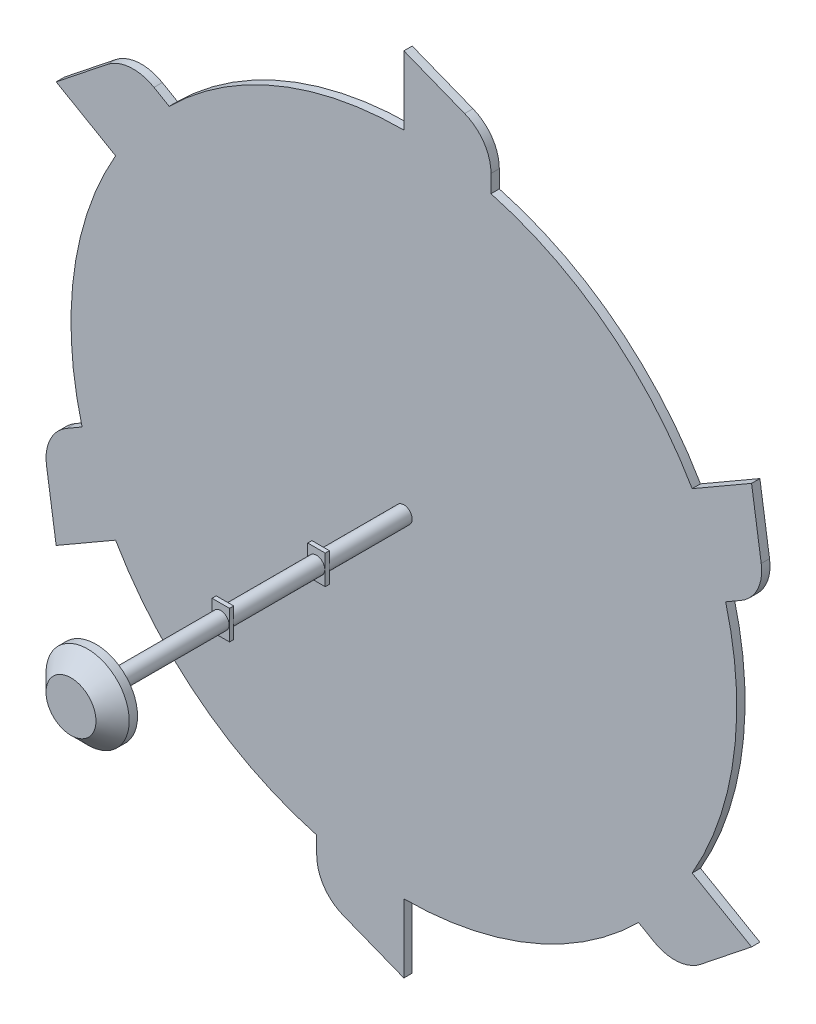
ISO-10303-21;
HEADER;
FILE_DESCRIPTION(('STEP AP214'),'2;1');
FILE_NAME('part.step','',(''),(''),'','','');
FILE_SCHEMA(('AUTOMOTIVE_DESIGN { 1 0 10303 214 1 1 1 1 }'));
ENDSEC;
DATA;
#1=APPLICATION_CONTEXT('core data for automotive mechanical design processes');
#2=APPLICATION_PROTOCOL_DEFINITION('international standard','automotive_design',2000,#1);
#3=PRODUCT_CONTEXT('',#1,'mechanical');
#4=PRODUCT('Part','Part','',(#3));
#5=PRODUCT_RELATED_PRODUCT_CATEGORY('part','',(#4));
#6=PRODUCT_DEFINITION_FORMATION('','',#4);
#7=PRODUCT_DEFINITION_CONTEXT('part definition',#1,'design');
#8=PRODUCT_DEFINITION('design','',#6,#7);
#9=PRODUCT_DEFINITION_SHAPE('','',#8);
#10=(LENGTH_UNIT() NAMED_UNIT(*) SI_UNIT(.MILLI.,.METRE.));
#11=(NAMED_UNIT(*) PLANE_ANGLE_UNIT() SI_UNIT($,.RADIAN.));
#12=(NAMED_UNIT(*) SI_UNIT($,.STERADIAN.) SOLID_ANGLE_UNIT());
#13=UNCERTAINTY_MEASURE_WITH_UNIT(LENGTH_MEASURE(1.E-05),#10,'distance_accuracy_value','');
#14=(GEOMETRIC_REPRESENTATION_CONTEXT(3) GLOBAL_UNCERTAINTY_ASSIGNED_CONTEXT((#13)) GLOBAL_UNIT_ASSIGNED_CONTEXT((#10,
#11,#12)) REPRESENTATION_CONTEXT('',''));
#15=CARTESIAN_POINT('',(0.,0.,0.));
#16=DIRECTION('',(0.,0.,1.));
#17=DIRECTION('',(1.,0.,0.));
#18=AXIS2_PLACEMENT_3D('',#15,#16,#17);
#19=CARTESIAN_POINT('',(0.,0.,-230.));
#20=DIRECTION('',(0.,0.,1.));
#21=DIRECTION('',(1.,0.,0.));
#22=AXIS2_PLACEMENT_3D('',#19,#20,#21);
#23=CYLINDRICAL_SURFACE('',#22,400.);
#24=CARTESIAN_POINT('',(0.,0.,-220.));
#25=DIRECTION('',(0.,0.,-1.));
#26=DIRECTION('',(-1.,0.,0.));
#27=AXIS2_PLACEMENT_3D('',#24,#25,#26);
#28=CIRCLE('',#27,400.);
#29=CARTESIAN_POINT('',(-104.68802698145,-386.057530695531,-220.));
#30=VERTEX_POINT('',#29);
#31=CARTESIAN_POINT('',(-346.410161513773,-200.000000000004,-220.));
#32=VERTEX_POINT('',#31);
#33=EDGE_CURVE('E300',#30,#32,#28,.T.);
#34=ORIENTED_EDGE('',*,*,#33,.T.);
#35=DIRECTION('',(0.,0.,1.));
#36=VECTOR('',#35,1.);
#37=CARTESIAN_POINT('',(-346.410161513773,-200.000000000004,-230.));
#38=LINE('',#37,#36);
#39=CARTESIAN_POINT('',(-346.410161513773,-200.000000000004,-230.));
#40=VERTEX_POINT('',#39);
#41=EDGE_CURVE('E478',#40,#32,#38,.T.);
#42=ORIENTED_EDGE('',*,*,#41,.F.);
#43=CARTESIAN_POINT('',(0.,0.,-230.));
#44=DIRECTION('',(0.,0.,-1.));
#45=DIRECTION('',(-1.,0.,0.));
#46=AXIS2_PLACEMENT_3D('',#43,#44,#45);
#47=CIRCLE('',#46,400.);
#48=CARTESIAN_POINT('',(-104.68802698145,-386.057530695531,-230.));
#49=VERTEX_POINT('',#48);
#50=EDGE_CURVE('E311',#49,#40,#47,.T.);
#51=ORIENTED_EDGE('',*,*,#50,.F.);
#52=DIRECTION('',(0.,0.,1.));
#53=VECTOR('',#52,1.);
#54=CARTESIAN_POINT('',(-104.68802698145,-386.057530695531,-230.));
#55=LINE('',#54,#53);
#56=EDGE_CURVE('E309',#49,#30,#55,.T.);
#57=ORIENTED_EDGE('',*,*,#56,.T.);
#58=EDGE_LOOP('',(#34,#42,#51,#57));
#59=FACE_BOUND('',#58,.T.);
#60=ADVANCED_FACE('F32',(#59),#23,.T.);
#61=CARTESIAN_POINT('',(-386.679642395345,-102.366274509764,-230.));
#62=VERTEX_POINT('',#61);
#63=CARTESIAN_POINT('',(-346.410161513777,199.999999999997,-230.));
#64=VERTEX_POINT('',#63);
#65=EDGE_CURVE('E291',#62,#64,#47,.T.);
#66=ORIENTED_EDGE('',*,*,#65,.F.);
#67=DIRECTION('',(0.,0.,1.));
#68=VECTOR('',#67,1.);
#69=CARTESIAN_POINT('',(-386.679642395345,-102.366274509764,-230.));
#70=LINE('',#69,#68);
#71=CARTESIAN_POINT('',(-386.679642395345,-102.366274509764,-220.));
#72=VERTEX_POINT('',#71);
#73=EDGE_CURVE('E279',#62,#72,#70,.T.);
#74=ORIENTED_EDGE('',*,*,#73,.T.);
#75=CARTESIAN_POINT('',(-346.410161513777,199.999999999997,-220.));
#76=VERTEX_POINT('',#75);
#77=EDGE_CURVE('E289',#72,#76,#28,.T.);
#78=ORIENTED_EDGE('',*,*,#77,.T.);
#79=DIRECTION('',(0.,0.,1.));
#80=VECTOR('',#79,1.);
#81=CARTESIAN_POINT('',(-346.410161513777,199.999999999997,-230.));
#82=LINE('',#81,#80);
#83=EDGE_CURVE('E485',#64,#76,#82,.T.);
#84=ORIENTED_EDGE('',*,*,#83,.F.);
#85=EDGE_LOOP('',(#66,#74,#78,#84));
#86=FACE_BOUND('',#85,.T.);
#87=ADVANCED_FACE('F287',(#86),#23,.T.);
#88=CARTESIAN_POINT('',(-281.991615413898,283.69125618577,-230.));
#89=VERTEX_POINT('',#88);
#90=CARTESIAN_POINT('',(-2.79318668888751E-12,400.,-230.));
#91=VERTEX_POINT('',#90);
#92=EDGE_CURVE('E653',#89,#91,#47,.T.);
#93=ORIENTED_EDGE('',*,*,#92,.F.);
#94=DIRECTION('',(0.,0.,1.));
#95=VECTOR('',#94,1.);
#96=CARTESIAN_POINT('',(-281.991615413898,283.69125618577,-230.));
#97=LINE('',#96,#95);
#98=CARTESIAN_POINT('',(-281.991615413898,283.69125618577,-220.));
#99=VERTEX_POINT('',#98);
#100=EDGE_CURVE('E463',#89,#99,#97,.T.);
#101=ORIENTED_EDGE('',*,*,#100,.T.);
#102=CARTESIAN_POINT('',(-2.79318668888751E-12,400.,-220.));
#103=VERTEX_POINT('',#102);
#104=EDGE_CURVE('E301',#99,#103,#28,.T.);
#105=ORIENTED_EDGE('',*,*,#104,.T.);
#106=DIRECTION('',(0.,0.,1.));
#107=VECTOR('',#106,1.);
#108=CARTESIAN_POINT('',(-2.79318668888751E-12,400.,-230.));
#109=LINE('',#108,#107);
#110=EDGE_CURVE('E506',#91,#103,#109,.T.);
#111=ORIENTED_EDGE('',*,*,#110,.F.);
#112=EDGE_LOOP('',(#93,#101,#105,#111));
#113=FACE_BOUND('',#112,.T.);
#114=ADVANCED_FACE('F674',(#113),#23,.T.);
#115=CARTESIAN_POINT('',(104.688026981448,386.057530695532,-230.));
#116=VERTEX_POINT('',#115);
#117=CARTESIAN_POINT('',(346.410161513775,200.000000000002,-230.));
#118=VERTEX_POINT('',#117);
#119=EDGE_CURVE('E652',#116,#118,#47,.T.);
#120=ORIENTED_EDGE('',*,*,#119,.F.);
#121=DIRECTION('',(0.,0.,1.));
#122=VECTOR('',#121,1.);
#123=CARTESIAN_POINT('',(104.688026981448,386.057530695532,-230.));
#124=LINE('',#123,#122);
#125=CARTESIAN_POINT('',(104.688026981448,386.057530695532,-220.));
#126=VERTEX_POINT('',#125);
#127=EDGE_CURVE('E505',#116,#126,#124,.T.);
#128=ORIENTED_EDGE('',*,*,#127,.T.);
#129=CARTESIAN_POINT('',(346.410161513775,200.000000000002,-220.));
#130=VERTEX_POINT('',#129);
#131=EDGE_CURVE('E306',#126,#130,#28,.T.);
#132=ORIENTED_EDGE('',*,*,#131,.T.);
#133=DIRECTION('',(0.,0.,1.));
#134=VECTOR('',#133,1.);
#135=CARTESIAN_POINT('',(346.410161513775,200.000000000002,-230.));
#136=LINE('',#135,#134);
#137=EDGE_CURVE('E531',#118,#130,#136,.T.);
#138=ORIENTED_EDGE('',*,*,#137,.F.);
#139=EDGE_LOOP('',(#120,#128,#132,#138));
#140=FACE_BOUND('',#139,.T.);
#141=ADVANCED_FACE('F639',(#140),#23,.T.);
#142=CARTESIAN_POINT('',(386.679642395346,102.366274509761,-230.));
#143=VERTEX_POINT('',#142);
#144=CARTESIAN_POINT('',(346.410161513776,-199.999999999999,-230.));
#145=VERTEX_POINT('',#144);
#146=EDGE_CURVE('E654',#143,#145,#47,.T.);
#147=ORIENTED_EDGE('',*,*,#146,.F.);
#148=DIRECTION('',(0.,0.,1.));
#149=VECTOR('',#148,1.);
#150=CARTESIAN_POINT('',(386.679642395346,102.366274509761,-230.));
#151=LINE('',#150,#149);
#152=CARTESIAN_POINT('',(386.679642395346,102.366274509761,-220.));
#153=VERTEX_POINT('',#152);
#154=EDGE_CURVE('E530',#143,#153,#151,.T.);
#155=ORIENTED_EDGE('',*,*,#154,.T.);
#156=CARTESIAN_POINT('',(346.410161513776,-199.999999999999,-220.));
#157=VERTEX_POINT('',#156);
#158=EDGE_CURVE('E631',#153,#157,#28,.T.);
#159=ORIENTED_EDGE('',*,*,#158,.T.);
#160=DIRECTION('',(0.,0.,1.));
#161=VECTOR('',#160,1.);
#162=CARTESIAN_POINT('',(346.410161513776,-199.999999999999,-230.));
#163=LINE('',#162,#161);
#164=EDGE_CURVE('E556',#145,#157,#163,.T.);
#165=ORIENTED_EDGE('',*,*,#164,.F.);
#166=EDGE_LOOP('',(#147,#155,#159,#165));
#167=FACE_BOUND('',#166,.T.);
#168=ADVANCED_FACE('F663',(#167),#23,.T.);
#169=CARTESIAN_POINT('',(10.5,17.5,-120.));
#170=DIRECTION('',(0.,0.,-1.));
#171=DIRECTION('',(-1.,0.,0.));
#172=AXIS2_PLACEMENT_3D('',#169,#170,#171);
#173=PLANE('',#172);
#174=DIRECTION('',(1.,0.,0.));
#175=VECTOR('',#174,1.);
#176=CARTESIAN_POINT('',(-10.5,17.5,-120.));
#177=LINE('',#176,#175);
#178=CARTESIAN_POINT('',(-10.5,17.5,-120.));
#179=VERTEX_POINT('',#178);
#180=CARTESIAN_POINT('',(10.5,17.5,-120.));
#181=VERTEX_POINT('',#180);
#182=EDGE_CURVE('E332',#179,#181,#177,.T.);
#183=ORIENTED_EDGE('',*,*,#182,.T.);
#184=DIRECTION('',(0.,-1.,0.));
#185=VECTOR('',#184,1.);
#186=CARTESIAN_POINT('',(10.5,17.5,-120.));
#187=LINE('',#186,#185);
#188=CARTESIAN_POINT('',(10.5,-17.5,-120.));
#189=VERTEX_POINT('',#188);
#190=EDGE_CURVE('E335',#181,#189,#187,.T.);
#191=ORIENTED_EDGE('',*,*,#190,.T.);
#192=DIRECTION('',(-1.,0.,0.));
#193=VECTOR('',#192,1.);
#194=CARTESIAN_POINT('',(10.5,-17.5,-120.));
#195=LINE('',#194,#193);
#196=CARTESIAN_POINT('',(-10.5,-17.5,-120.));
#197=VERTEX_POINT('',#196);
#198=EDGE_CURVE('E337',#189,#197,#195,.T.);
#199=ORIENTED_EDGE('',*,*,#198,.T.);
#200=DIRECTION('',(0.,1.,0.));
#201=VECTOR('',#200,1.);
#202=CARTESIAN_POINT('',(-10.5,-17.5,-120.));
#203=LINE('',#202,#201);
#204=EDGE_CURVE('E339',#197,#179,#203,.T.);
#205=ORIENTED_EDGE('',*,*,#204,.T.);
#206=EDGE_LOOP('',(#183,#191,#199,#205));
#207=FACE_BOUND('',#206,.T.);
#208=CARTESIAN_POINT('',(0.,0.,-120.));
#209=DIRECTION('',(0.,0.,-1.));
#210=DIRECTION('',(-1.,0.,0.));
#211=AXIS2_PLACEMENT_3D('',#208,#209,#210);
#212=CIRCLE('',#211,10.);
#213=CARTESIAN_POINT('',(-10.,0.,-120.));
#214=VERTEX_POINT('',#213);
#215=EDGE_CURVE('E317',#214,#214,#212,.T.);
#216=ORIENTED_EDGE('',*,*,#215,.F.);
#217=EDGE_LOOP('',(#216));
#218=FACE_BOUND('',#217,.T.);
#219=ADVANCED_FACE('F665',(#207,#218),#173,.T.);
#220=CARTESIAN_POINT('',(10.5,-17.5,-5.));
#221=DIRECTION('',(0.,0.,-1.));
#222=DIRECTION('',(-1.,0.,0.));
#223=AXIS2_PLACEMENT_3D('',#220,#221,#222);
#224=PLANE('',#223);
#225=DIRECTION('',(0.,-1.,0.));
#226=VECTOR('',#225,1.);
#227=CARTESIAN_POINT('',(10.5,17.5,-5.));
#228=LINE('',#227,#226);
#229=CARTESIAN_POINT('',(10.5,17.5,-5.));
#230=VERTEX_POINT('',#229);
#231=CARTESIAN_POINT('',(10.5,-17.5,-5.));
#232=VERTEX_POINT('',#231);
#233=EDGE_CURVE('E368',#230,#232,#228,.T.);
#234=ORIENTED_EDGE('',*,*,#233,.T.);
#235=DIRECTION('',(-1.,0.,0.));
#236=VECTOR('',#235,1.);
#237=CARTESIAN_POINT('',(10.5,-17.5,-5.));
#238=LINE('',#237,#236);
#239=CARTESIAN_POINT('',(-10.5,-17.5,-5.));
#240=VERTEX_POINT('',#239);
#241=EDGE_CURVE('E371',#232,#240,#238,.T.);
#242=ORIENTED_EDGE('',*,*,#241,.T.);
#243=DIRECTION('',(0.,1.,0.));
#244=VECTOR('',#243,1.);
#245=CARTESIAN_POINT('',(-10.5,17.5,-5.));
#246=LINE('',#245,#244);
#247=CARTESIAN_POINT('',(-10.5,17.5,-5.));
#248=VERTEX_POINT('',#247);
#249=EDGE_CURVE('E373',#240,#248,#246,.T.);
#250=ORIENTED_EDGE('',*,*,#249,.T.);
#251=DIRECTION('',(1.,0.,0.));
#252=VECTOR('',#251,1.);
#253=CARTESIAN_POINT('',(10.5,17.5,-5.));
#254=LINE('',#253,#252);
#255=EDGE_CURVE('E375',#248,#230,#254,.T.);
#256=ORIENTED_EDGE('',*,*,#255,.T.);
#257=EDGE_LOOP('',(#234,#242,#250,#256));
#258=FACE_BOUND('',#257,.T.);
#259=CARTESIAN_POINT('',(0.,0.,-5.));
#260=DIRECTION('',(0.,0.,-1.));
#261=DIRECTION('',(-1.,0.,0.));
#262=AXIS2_PLACEMENT_3D('',#259,#260,#261);
#263=CIRCLE('',#262,10.);
#264=CARTESIAN_POINT('',(-10.,0.,-5.));
#265=VERTEX_POINT('',#264);
#266=EDGE_CURVE('E353',#265,#265,#263,.T.);
#267=ORIENTED_EDGE('',*,*,#266,.F.);
#268=EDGE_LOOP('',(#267));
#269=FACE_BOUND('',#268,.T.);
#270=ADVANCED_FACE('F671',(#258,#269),#224,.T.);
#271=CARTESIAN_POINT('',(0.,0.,150.));
#272=DIRECTION('',(0.,0.,-1.));
#273=DIRECTION('',(-1.,0.,0.));
#274=AXIS2_PLACEMENT_3D('',#271,#272,#273);
#275=CYLINDRICAL_SURFACE('',#274,10.);
#276=CARTESIAN_POINT('',(0.,0.,150.));
#277=DIRECTION('',(0.,0.,1.));
#278=DIRECTION('',(1.,0.,0.));
#279=AXIS2_PLACEMENT_3D('',#276,#277,#278);
#280=CIRCLE('',#279,10.);
#281=CARTESIAN_POINT('',(10.,0.,150.));
#282=VERTEX_POINT('',#281);
#283=EDGE_CURVE('E392',#282,#282,#280,.T.);
#284=ORIENTED_EDGE('',*,*,#283,.F.);
#285=EDGE_LOOP('',(#284));
#286=FACE_BOUND('',#285,.T.);
#287=CARTESIAN_POINT('',(0.,0.,0.));
#288=DIRECTION('',(0.,0.,-1.));
#289=DIRECTION('',(-1.,0.,0.));
#290=AXIS2_PLACEMENT_3D('',#287,#288,#289);
#291=CIRCLE('',#290,10.);
#292=CARTESIAN_POINT('',(-10.,0.,0.));
#293=VERTEX_POINT('',#292);
#294=EDGE_CURVE('E389',#293,#293,#291,.T.);
#295=ORIENTED_EDGE('',*,*,#294,.F.);
#296=EDGE_LOOP('',(#295));
#297=FACE_BOUND('',#296,.T.);
#298=ADVANCED_FACE('F34',(#286,#297),#275,.T.);
#299=CARTESIAN_POINT('',(10.5,-17.5,0.));
#300=DIRECTION('',(0.,0.,-1.));
#301=DIRECTION('',(-1.,0.,0.));
#302=AXIS2_PLACEMENT_3D('',#299,#300,#301);
#303=PLANE('',#302);
#304=DIRECTION('',(0.,-1.,0.));
#305=VECTOR('',#304,1.);
#306=CARTESIAN_POINT('',(10.5,17.5,0.));
#307=LINE('',#306,#305);
#308=CARTESIAN_POINT('',(10.5,17.5,0.));
#309=VERTEX_POINT('',#308);
#310=CARTESIAN_POINT('',(10.5,-17.5,0.));
#311=VERTEX_POINT('',#310);
#312=EDGE_CURVE('E359',#309,#311,#307,.T.);
#313=ORIENTED_EDGE('',*,*,#312,.F.);
#314=DIRECTION('',(1.,0.,0.));
#315=VECTOR('',#314,1.);
#316=CARTESIAN_POINT('',(10.5,17.5,0.));
#317=LINE('',#316,#315);
#318=CARTESIAN_POINT('',(-10.5,17.5,0.));
#319=VERTEX_POINT('',#318);
#320=EDGE_CURVE('E366',#319,#309,#317,.T.);
#321=ORIENTED_EDGE('',*,*,#320,.F.);
#322=DIRECTION('',(0.,1.,0.));
#323=VECTOR('',#322,1.);
#324=CARTESIAN_POINT('',(-10.5,17.5,0.));
#325=LINE('',#324,#323);
#326=CARTESIAN_POINT('',(-10.5,-17.5,0.));
#327=VERTEX_POINT('',#326);
#328=EDGE_CURVE('E364',#327,#319,#325,.T.);
#329=ORIENTED_EDGE('',*,*,#328,.F.);
#330=DIRECTION('',(-1.,0.,0.));
#331=VECTOR('',#330,1.);
#332=CARTESIAN_POINT('',(10.5,-17.5,0.));
#333=LINE('',#332,#331);
#334=EDGE_CURVE('E362',#311,#327,#333,.T.);
#335=ORIENTED_EDGE('',*,*,#334,.F.);
#336=EDGE_LOOP('',(#313,#321,#329,#335));
#337=FACE_BOUND('',#336,.T.);
#338=ORIENTED_EDGE('',*,*,#294,.T.);
#339=EDGE_LOOP('',(#338));
#340=FACE_BOUND('',#339,.T.);
#341=ADVANCED_FACE('F1116',(#337,#340),#303,.F.);
#342=CARTESIAN_POINT('',(10.5,17.5,-5.));
#343=DIRECTION('',(-1.,0.,0.));
#344=DIRECTION('',(0.,-1.,0.));
#345=AXIS2_PLACEMENT_3D('',#342,#343,#344);
#346=PLANE('',#345);
#347=ORIENTED_EDGE('',*,*,#312,.T.);
#348=DIRECTION('',(0.,0.,1.));
#349=VECTOR('',#348,1.);
#350=CARTESIAN_POINT('',(10.5,-17.5,-5.));
#351=LINE('',#350,#349);
#352=EDGE_CURVE('E386',#232,#311,#351,.T.);
#353=ORIENTED_EDGE('',*,*,#352,.F.);
#354=ORIENTED_EDGE('',*,*,#233,.F.);
#355=DIRECTION('',(0.,0.,1.));
#356=VECTOR('',#355,1.);
#357=CARTESIAN_POINT('',(10.5,17.5,-5.));
#358=LINE('',#357,#356);
#359=EDGE_CURVE('E377',#230,#309,#358,.T.);
#360=ORIENTED_EDGE('',*,*,#359,.T.);
#361=EDGE_LOOP('',(#347,#353,#354,#360));
#362=FACE_BOUND('',#361,.T.);
#363=ADVANCED_FACE('F1107',(#362),#346,.F.);
#364=CARTESIAN_POINT('',(10.5,-17.5,-5.));
#365=DIRECTION('',(0.,1.,0.));
#366=DIRECTION('',(-1.,0.,0.));
#367=AXIS2_PLACEMENT_3D('',#364,#365,#366);
#368=PLANE('',#367);
#369=ORIENTED_EDGE('',*,*,#334,.T.);
#370=DIRECTION('',(0.,0.,1.));
#371=VECTOR('',#370,1.);
#372=CARTESIAN_POINT('',(-10.5,-17.5,-5.));
#373=LINE('',#372,#371);
#374=EDGE_CURVE('E383',#240,#327,#373,.T.);
#375=ORIENTED_EDGE('',*,*,#374,.F.);
#376=ORIENTED_EDGE('',*,*,#241,.F.);
#377=ORIENTED_EDGE('',*,*,#352,.T.);
#378=EDGE_LOOP('',(#369,#375,#376,#377));
#379=FACE_BOUND('',#378,.T.);
#380=ADVANCED_FACE('F1098',(#379),#368,.F.);
#381=CARTESIAN_POINT('',(-10.5,17.5,-5.));
#382=DIRECTION('',(1.,0.,0.));
#383=DIRECTION('',(0.,1.,0.));
#384=AXIS2_PLACEMENT_3D('',#381,#382,#383);
#385=PLANE('',#384);
#386=ORIENTED_EDGE('',*,*,#328,.T.);
#387=DIRECTION('',(0.,0.,1.));
#388=VECTOR('',#387,1.);
#389=CARTESIAN_POINT('',(-10.5,17.5,-5.));
#390=LINE('',#389,#388);
#391=EDGE_CURVE('E380',#248,#319,#390,.T.);
#392=ORIENTED_EDGE('',*,*,#391,.F.);
#393=ORIENTED_EDGE('',*,*,#249,.F.);
#394=ORIENTED_EDGE('',*,*,#374,.T.);
#395=EDGE_LOOP('',(#386,#392,#393,#394));
#396=FACE_BOUND('',#395,.T.);
#397=ADVANCED_FACE('F1089',(#396),#385,.F.);
#398=CARTESIAN_POINT('',(10.5,17.5,-5.));
#399=DIRECTION('',(0.,-1.,0.));
#400=DIRECTION('',(1.,0.,0.));
#401=AXIS2_PLACEMENT_3D('',#398,#399,#400);
#402=PLANE('',#401);
#403=ORIENTED_EDGE('',*,*,#320,.T.);
#404=ORIENTED_EDGE('',*,*,#359,.F.);
#405=ORIENTED_EDGE('',*,*,#255,.F.);
#406=ORIENTED_EDGE('',*,*,#391,.T.);
#407=EDGE_LOOP('',(#403,#404,#405,#406));
#408=FACE_BOUND('',#407,.T.);
#409=ADVANCED_FACE('F1072',(#408),#402,.F.);
#410=CARTESIAN_POINT('',(0.,0.,-115.));
#411=DIRECTION('',(0.,0.,1.));
#412=DIRECTION('',(1.,0.,0.));
#413=AXIS2_PLACEMENT_3D('',#410,#411,#412);
#414=CYLINDRICAL_SURFACE('',#413,10.);
#415=CARTESIAN_POINT('',(0.,0.,-115.));
#416=DIRECTION('',(0.,0.,-1.));
#417=DIRECTION('',(-1.,0.,0.));
#418=AXIS2_PLACEMENT_3D('',#415,#416,#417);
#419=CIRCLE('',#418,10.);
#420=CARTESIAN_POINT('',(-10.,0.,-115.));
#421=VERTEX_POINT('',#420);
#422=EDGE_CURVE('E356',#421,#421,#419,.T.);
#423=ORIENTED_EDGE('',*,*,#422,.F.);
#424=EDGE_LOOP('',(#423));
#425=FACE_BOUND('',#424,.T.);
#426=ORIENTED_EDGE('',*,*,#266,.T.);
#427=EDGE_LOOP('',(#426));
#428=FACE_BOUND('',#427,.T.);
#429=ADVANCED_FACE('F1063',(#425,#428),#414,.T.);
#430=CARTESIAN_POINT('',(10.5,17.5,-115.));
#431=DIRECTION('',(0.,0.,-1.));
#432=DIRECTION('',(-1.,0.,0.));
#433=AXIS2_PLACEMENT_3D('',#430,#431,#432);
#434=PLANE('',#433);
#435=DIRECTION('',(1.,0.,0.));
#436=VECTOR('',#435,1.);
#437=CARTESIAN_POINT('',(-10.5,17.5,-115.));
#438=LINE('',#437,#436);
#439=CARTESIAN_POINT('',(-10.5,17.5,-115.));
#440=VERTEX_POINT('',#439);
#441=CARTESIAN_POINT('',(10.5,17.5,-115.));
#442=VERTEX_POINT('',#441);
#443=EDGE_CURVE('E323',#440,#442,#438,.T.);
#444=ORIENTED_EDGE('',*,*,#443,.F.);
#445=DIRECTION('',(0.,1.,0.));
#446=VECTOR('',#445,1.);
#447=CARTESIAN_POINT('',(-10.5,-17.5,-115.));
#448=LINE('',#447,#446);
#449=CARTESIAN_POINT('',(-10.5,-17.5,-115.));
#450=VERTEX_POINT('',#449);
#451=EDGE_CURVE('E330',#450,#440,#448,.T.);
#452=ORIENTED_EDGE('',*,*,#451,.F.);
#453=DIRECTION('',(-1.,0.,0.));
#454=VECTOR('',#453,1.);
#455=CARTESIAN_POINT('',(10.5,-17.5,-115.));
#456=LINE('',#455,#454);
#457=CARTESIAN_POINT('',(10.5,-17.5,-115.));
#458=VERTEX_POINT('',#457);
#459=EDGE_CURVE('E328',#458,#450,#456,.T.);
#460=ORIENTED_EDGE('',*,*,#459,.F.);
#461=DIRECTION('',(0.,-1.,0.));
#462=VECTOR('',#461,1.);
#463=CARTESIAN_POINT('',(10.5,17.5,-115.));
#464=LINE('',#463,#462);
#465=EDGE_CURVE('E326',#442,#458,#464,.T.);
#466=ORIENTED_EDGE('',*,*,#465,.F.);
#467=EDGE_LOOP('',(#444,#452,#460,#466));
#468=FACE_BOUND('',#467,.T.);
#469=ORIENTED_EDGE('',*,*,#422,.T.);
#470=EDGE_LOOP('',(#469));
#471=FACE_BOUND('',#470,.T.);
#472=ADVANCED_FACE('F1054',(#468,#471),#434,.F.);
#473=CARTESIAN_POINT('',(-10.5,17.5,-120.));
#474=DIRECTION('',(0.,-1.,0.));
#475=DIRECTION('',(1.,0.,0.));
#476=AXIS2_PLACEMENT_3D('',#473,#474,#475);
#477=PLANE('',#476);
#478=ORIENTED_EDGE('',*,*,#443,.T.);
#479=DIRECTION('',(0.,0.,1.));
#480=VECTOR('',#479,1.);
#481=CARTESIAN_POINT('',(10.5,17.5,-120.));
#482=LINE('',#481,#480);
#483=EDGE_CURVE('E350',#181,#442,#482,.T.);
#484=ORIENTED_EDGE('',*,*,#483,.F.);
#485=ORIENTED_EDGE('',*,*,#182,.F.);
#486=DIRECTION('',(0.,0.,1.));
#487=VECTOR('',#486,1.);
#488=CARTESIAN_POINT('',(-10.5,17.5,-120.));
#489=LINE('',#488,#487);
#490=EDGE_CURVE('E341',#179,#440,#489,.T.);
#491=ORIENTED_EDGE('',*,*,#490,.T.);
#492=EDGE_LOOP('',(#478,#484,#485,#491));
#493=FACE_BOUND('',#492,.T.);
#494=ADVANCED_FACE('F1045',(#493),#477,.F.);
#495=CARTESIAN_POINT('',(10.5,17.5,-120.));
#496=DIRECTION('',(-1.,0.,0.));
#497=DIRECTION('',(0.,-1.,0.));
#498=AXIS2_PLACEMENT_3D('',#495,#496,#497);
#499=PLANE('',#498);
#500=ORIENTED_EDGE('',*,*,#465,.T.);
#501=DIRECTION('',(0.,0.,1.));
#502=VECTOR('',#501,1.);
#503=CARTESIAN_POINT('',(10.5,-17.5,-120.));
#504=LINE('',#503,#502);
#505=EDGE_CURVE('E347',#189,#458,#504,.T.);
#506=ORIENTED_EDGE('',*,*,#505,.F.);
#507=ORIENTED_EDGE('',*,*,#190,.F.);
#508=ORIENTED_EDGE('',*,*,#483,.T.);
#509=EDGE_LOOP('',(#500,#506,#507,#508));
#510=FACE_BOUND('',#509,.T.);
#511=ADVANCED_FACE('F1036',(#510),#499,.F.);
#512=CARTESIAN_POINT('',(10.5,-17.5,-120.));
#513=DIRECTION('',(0.,1.,0.));
#514=DIRECTION('',(-1.,0.,0.));
#515=AXIS2_PLACEMENT_3D('',#512,#513,#514);
#516=PLANE('',#515);
#517=ORIENTED_EDGE('',*,*,#459,.T.);
#518=DIRECTION('',(0.,0.,1.));
#519=VECTOR('',#518,1.);
#520=CARTESIAN_POINT('',(-10.5,-17.5,-120.));
#521=LINE('',#520,#519);
#522=EDGE_CURVE('E344',#197,#450,#521,.T.);
#523=ORIENTED_EDGE('',*,*,#522,.F.);
#524=ORIENTED_EDGE('',*,*,#198,.F.);
#525=ORIENTED_EDGE('',*,*,#505,.T.);
#526=EDGE_LOOP('',(#517,#523,#524,#525));
#527=FACE_BOUND('',#526,.T.);
#528=ADVANCED_FACE('F1027',(#527),#516,.F.);
#529=CARTESIAN_POINT('',(-10.5,-17.5,-120.));
#530=DIRECTION('',(1.,0.,0.));
#531=DIRECTION('',(0.,1.,0.));
#532=AXIS2_PLACEMENT_3D('',#529,#530,#531);
#533=PLANE('',#532);
#534=ORIENTED_EDGE('',*,*,#451,.T.);
#535=ORIENTED_EDGE('',*,*,#490,.F.);
#536=ORIENTED_EDGE('',*,*,#204,.F.);
#537=ORIENTED_EDGE('',*,*,#522,.T.);
#538=EDGE_LOOP('',(#534,#535,#536,#537));
#539=FACE_BOUND('',#538,.T.);
#540=ADVANCED_FACE('F1013',(#539),#533,.F.);
#541=CARTESIAN_POINT('',(0.,0.,-220.));
#542=DIRECTION('',(0.,0.,1.));
#543=DIRECTION('',(1.,0.,0.));
#544=AXIS2_PLACEMENT_3D('',#541,#542,#543);
#545=CYLINDRICAL_SURFACE('',#544,10.);
#546=CARTESIAN_POINT('',(0.,0.,-220.));
#547=DIRECTION('',(0.,0.,-1.));
#548=DIRECTION('',(-1.,0.,0.));
#549=AXIS2_PLACEMENT_3D('',#546,#547,#548);
#550=CIRCLE('',#549,10.);
#551=CARTESIAN_POINT('',(-10.,0.,-220.));
#552=VERTEX_POINT('',#551);
#553=EDGE_CURVE('E320',#552,#552,#550,.T.);
#554=ORIENTED_EDGE('',*,*,#553,.F.);
#555=EDGE_LOOP('',(#554));
#556=FACE_BOUND('',#555,.T.);
#557=ORIENTED_EDGE('',*,*,#215,.T.);
#558=EDGE_LOOP('',(#557));
#559=FACE_BOUND('',#558,.T.);
#560=ADVANCED_FACE('F1004',(#556,#559),#545,.T.);
#561=CARTESIAN_POINT('',(0.,0.,150.));
#562=DIRECTION('',(0.,0.,1.));
#563=DIRECTION('',(1.,0.,0.));
#564=AXIS2_PLACEMENT_3D('',#561,#562,#563);
#565=PLANE('',#564);
#566=CARTESIAN_POINT('',(0.,0.,150.));
#567=DIRECTION('',(0.,0.,1.));
#568=DIRECTION('',(1.,0.,0.));
#569=AXIS2_PLACEMENT_3D('',#566,#567,#568);
#570=CIRCLE('',#569,50.);
#571=CARTESIAN_POINT('',(50.,0.,150.));
#572=VERTEX_POINT('',#571);
#573=EDGE_CURVE('E314',#572,#572,#570,.T.);
#574=ORIENTED_EDGE('',*,*,#573,.F.);
#575=EDGE_LOOP('',(#574));
#576=FACE_BOUND('',#575,.T.);
#577=ORIENTED_EDGE('',*,*,#283,.T.);
#578=EDGE_LOOP('',(#577));
#579=FACE_BOUND('',#578,.T.);
#580=ADVANCED_FACE('F995',(#576,#579),#565,.F.);
#581=CARTESIAN_POINT('',(0.,0.,180.));
#582=DIRECTION('',(0.,0.,-1.));
#583=DIRECTION('',(-1.,0.,0.));
#584=AXIS2_PLACEMENT_3D('',#581,#582,#583);
#585=CYLINDRICAL_SURFACE('',#584,50.);
#586=CARTESIAN_POINT('',(0.,0.,160.));
#587=DIRECTION('',(0.,0.,1.));
#588=DIRECTION('',(1.,0.,0.));
#589=AXIS2_PLACEMENT_3D('',#586,#587,#588);
#590=CIRCLE('',#589,50.);
#591=CARTESIAN_POINT('',(50.,0.,160.));
#592=VERTEX_POINT('',#591);
#593=EDGE_CURVE('E398',#592,#592,#590,.F.);
#594=ORIENTED_EDGE('',*,*,#593,.T.);
#595=EDGE_LOOP('',(#594));
#596=FACE_BOUND('',#595,.T.);
#597=ORIENTED_EDGE('',*,*,#573,.T.);
#598=EDGE_LOOP('',(#597));
#599=FACE_BOUND('',#598,.T.);
#600=ADVANCED_FACE('F986',(#596,#599),#585,.T.);
#601=CARTESIAN_POINT('',(0.,0.,180.));
#602=DIRECTION('',(0.,0.,1.));
#603=DIRECTION('',(1.,0.,0.));
#604=AXIS2_PLACEMENT_3D('',#601,#602,#603);
#605=PLANE('',#604);
#606=CARTESIAN_POINT('',(0.,0.,180.));
#607=DIRECTION('',(0.,0.,1.));
#608=DIRECTION('',(1.,0.,0.));
#609=AXIS2_PLACEMENT_3D('',#606,#607,#608);
#610=CIRCLE('',#609,30.);
#611=CARTESIAN_POINT('',(30.,0.,180.));
#612=VERTEX_POINT('',#611);
#613=EDGE_CURVE('E395',#612,#612,#610,.T.);
#614=ORIENTED_EDGE('',*,*,#613,.T.);
#615=EDGE_LOOP('',(#614));
#616=FACE_BOUND('',#615,.T.);
#617=ADVANCED_FACE('F978',(#616),#605,.T.);
#618=CARTESIAN_POINT('',(0.,0.,180.));
#619=DIRECTION('',(0.,0.,-1.));
#620=DIRECTION('',(-1.,0.,0.));
#621=AXIS2_PLACEMENT_3D('',#618,#619,#620);
#622=CONICAL_SURFACE('',#621,30.,0.785398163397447);
#623=ORIENTED_EDGE('',*,*,#593,.F.);
#624=EDGE_LOOP('',(#623));
#625=FACE_BOUND('',#624,.T.);
#626=ORIENTED_EDGE('',*,*,#613,.F.);
#627=EDGE_LOOP('',(#626));
#628=FACE_BOUND('',#627,.T.);
#629=ADVANCED_FACE('F744',(#625,#628),#622,.T.);
#630=CARTESIAN_POINT('',(0.,0.,-220.));
#631=DIRECTION('',(0.,0.,-1.));
#632=DIRECTION('',(-1.,0.,0.));
#633=AXIS2_PLACEMENT_3D('',#630,#631,#632);
#634=PLANE('',#633);
#635=DIRECTION('',(-0.866025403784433,-0.50000000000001,0.));
#636=VECTOR('',#635,1.);
#637=CARTESIAN_POINT('',(-434.446689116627,-129.94459179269,-220.));
#638=LINE('',#637,#636);
#639=CARTESIAN_POINT('',(-404.957733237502,-112.919135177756,-220.));
#640=VERTEX_POINT('',#639);
#641=EDGE_CURVE('E275',#72,#640,#638,.T.);
#642=ORIENTED_EDGE('',*,*,#641,.T.);
#643=CARTESIAN_POINT('',(-379.957733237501,-156.220405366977,-220.));
#644=DIRECTION('',(0.,0.,-1.));
#645=DIRECTION('',(-1.,0.,0.));
#646=AXIS2_PLACEMENT_3D('',#643,#644,#645);
#647=CIRCLE('',#646,50.);
#648=CARTESIAN_POINT('',(-429.40708644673,-163.620504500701,-220.));
#649=VERTEX_POINT('',#648);
#650=EDGE_CURVE('E54',#640,#649,#647,.F.);
#651=ORIENTED_EDGE('',*,*,#650,.T.);
#652=DIRECTION('',(0.14800198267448,-0.988987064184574,0.));
#653=VECTOR('',#652,1.);
#654=CARTESIAN_POINT('',(-417.795189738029,-241.214165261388,-220.));
#655=LINE('',#654,#653);
#656=CARTESIAN_POINT('',(-417.795189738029,-241.214165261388,-220.));
#657=VERTEX_POINT('',#656);
#658=EDGE_CURVE('E284',#649,#657,#655,.T.);
#659=ORIENTED_EDGE('',*,*,#658,.T.);
#660=DIRECTION('',(0.866025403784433,0.50000000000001,0.));
#661=VECTOR('',#660,1.);
#662=CARTESIAN_POINT('',(-346.410161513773,-200.000000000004,-220.));
#663=LINE('',#662,#661);
#664=EDGE_CURVE('E597',#657,#32,#663,.T.);
#665=ORIENTED_EDGE('',*,*,#664,.T.);
#666=ORIENTED_EDGE('',*,*,#33,.F.);
#667=DIRECTION('',(0.,-1.,0.));
#668=VECTOR('',#667,1.);
#669=CARTESIAN_POINT('',(-104.68802698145,-441.214165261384,-220.));
#670=LINE('',#669,#668);
#671=CARTESIAN_POINT('',(-104.68802698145,-407.163252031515,-220.));
#672=VERTEX_POINT('',#671);
#673=EDGE_CURVE('E559',#30,#672,#670,.T.);
#674=ORIENTED_EDGE('',*,*,#673,.T.);
#675=CARTESIAN_POINT('',(-54.6880269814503,-407.163252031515,-220.));
#676=DIRECTION('',(0.,0.,-1.));
#677=DIRECTION('',(-1.,0.,0.));
#678=AXIS2_PLACEMENT_3D('',#675,#676,#677);
#679=CIRCLE('',#678,50.);
#680=CARTESIAN_POINT('',(-73.004029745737,-453.687697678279,-220.));
#681=VERTEX_POINT('',#680);
#682=EDGE_CURVE('E404',#672,#681,#679,.F.);
#683=ORIENTED_EDGE('',*,*,#682,.T.);
#684=DIRECTION('',(0.930488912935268,-0.366320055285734,0.));
#685=VECTOR('',#684,1.);
#686=CARTESIAN_POINT('',(0.,-482.428330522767,-220.));
#687=LINE('',#686,#685);
#688=CARTESIAN_POINT('',(0.,-482.428330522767,-220.));
#689=VERTEX_POINT('',#688);
#690=EDGE_CURVE('E567',#681,#689,#687,.T.);
#691=ORIENTED_EDGE('',*,*,#690,.T.);
#692=DIRECTION('',(0.,1.,0.));
#693=VECTOR('',#692,1.);
#694=CARTESIAN_POINT('',(0.,-400.,-220.));
#695=LINE('',#694,#693);
#696=CARTESIAN_POINT('',(0.,-400.,-220.));
#697=VERTEX_POINT('',#696);
#698=EDGE_CURVE('E569',#689,#697,#695,.T.);
#699=ORIENTED_EDGE('',*,*,#698,.T.);
#700=CARTESIAN_POINT('',(281.991615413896,-283.691256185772,-220.));
#701=VERTEX_POINT('',#700);
#702=EDGE_CURVE('E305',#701,#697,#28,.T.);
#703=ORIENTED_EDGE('',*,*,#702,.F.);
#704=DIRECTION('',(0.86602540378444,-0.499999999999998,0.));
#705=VECTOR('',#704,1.);
#706=CARTESIAN_POINT('',(329.758662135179,-311.269573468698,-220.));
#707=LINE('',#706,#705);
#708=CARTESIAN_POINT('',(300.269706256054,-294.244116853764,-220.));
#709=VERTEX_POINT('',#708);
#710=EDGE_CURVE('E534',#701,#709,#707,.T.);
#711=ORIENTED_EDGE('',*,*,#710,.T.);
#712=CARTESIAN_POINT('',(325.269706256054,-250.942846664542,-220.));
#713=DIRECTION('',(0.,0.,-1.));
#714=DIRECTION('',(-1.,0.,0.));
#715=AXIS2_PLACEMENT_3D('',#712,#713,#714);
#716=CIRCLE('',#715,50.);
#717=CARTESIAN_POINT('',(356.403056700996,-290.067193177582,-220.));
#718=VERTEX_POINT('',#717);
#719=EDGE_CURVE('E413',#709,#718,#716,.F.);
#720=ORIENTED_EDGE('',*,*,#719,.T.);
#721=DIRECTION('',(0.782486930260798,0.622667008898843,0.));
#722=VECTOR('',#721,1.);
#723=CARTESIAN_POINT('',(417.795189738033,-241.214165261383,-220.));
#724=LINE('',#723,#722);
#725=CARTESIAN_POINT('',(417.795189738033,-241.214165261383,-220.));
#726=VERTEX_POINT('',#725);
#727=EDGE_CURVE('E542',#718,#726,#724,.T.);
#728=ORIENTED_EDGE('',*,*,#727,.T.);
#729=DIRECTION('',(-0.86602540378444,0.499999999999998,0.));
#730=VECTOR('',#729,1.);
#731=CARTESIAN_POINT('',(346.410161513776,-199.999999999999,-220.));
#732=LINE('',#731,#730);
#733=EDGE_CURVE('E544',#726,#157,#732,.T.);
#734=ORIENTED_EDGE('',*,*,#733,.T.);
#735=ORIENTED_EDGE('',*,*,#158,.F.);
#736=DIRECTION('',(0.866025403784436,0.500000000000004,0.));
#737=VECTOR('',#736,1.);
#738=CARTESIAN_POINT('',(434.446689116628,129.944591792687,-220.));
#739=LINE('',#738,#737);
#740=CARTESIAN_POINT('',(404.957733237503,112.919135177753,-220.));
#741=VERTEX_POINT('',#740);
#742=EDGE_CURVE('E509',#153,#741,#739,.T.);
#743=ORIENTED_EDGE('',*,*,#742,.T.);
#744=CARTESIAN_POINT('',(379.957733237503,156.220405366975,-220.));
#745=DIRECTION('',(0.,0.,-1.));
#746=DIRECTION('',(-1.,0.,0.));
#747=AXIS2_PLACEMENT_3D('',#744,#745,#746);
#748=CIRCLE('',#747,50.);
#749=CARTESIAN_POINT('',(429.407086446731,163.620504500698,-220.));
#750=VERTEX_POINT('',#749);
#751=EDGE_CURVE('E422',#741,#750,#748,.F.);
#752=ORIENTED_EDGE('',*,*,#751,.T.);
#753=DIRECTION('',(-0.148001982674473,0.988987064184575,0.));
#754=VECTOR('',#753,1.);
#755=CARTESIAN_POINT('',(417.795189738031,241.214165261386,-220.));
#756=LINE('',#755,#754);
#757=CARTESIAN_POINT('',(417.795189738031,241.214165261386,-220.));
#758=VERTEX_POINT('',#757);
#759=EDGE_CURVE('E517',#750,#758,#756,.T.);
#760=ORIENTED_EDGE('',*,*,#759,.T.);
#761=DIRECTION('',(-0.866025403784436,-0.500000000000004,0.));
#762=VECTOR('',#761,1.);
#763=CARTESIAN_POINT('',(346.410161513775,200.000000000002,-220.));
#764=LINE('',#763,#762);
#765=EDGE_CURVE('E519',#758,#130,#764,.T.);
#766=ORIENTED_EDGE('',*,*,#765,.T.);
#767=ORIENTED_EDGE('',*,*,#131,.F.);
#768=DIRECTION('',(0.,1.,0.));
#769=VECTOR('',#768,1.);
#770=CARTESIAN_POINT('',(104.688026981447,441.214165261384,-220.));
#771=LINE('',#770,#769);
#772=CARTESIAN_POINT('',(104.688026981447,407.163252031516,-220.));
#773=VERTEX_POINT('',#772);
#774=EDGE_CURVE('E487',#126,#773,#771,.T.);
#775=ORIENTED_EDGE('',*,*,#774,.T.);
#776=CARTESIAN_POINT('',(54.6880269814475,407.163252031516,-220.));
#777=DIRECTION('',(0.,0.,-1.));
#778=DIRECTION('',(-1.,0.,0.));
#779=AXIS2_PLACEMENT_3D('',#776,#777,#778);
#780=CIRCLE('',#779,50.);
#781=CARTESIAN_POINT('',(73.0040297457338,453.687697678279,-220.));
#782=VERTEX_POINT('',#781);
#783=EDGE_CURVE('E431',#773,#782,#780,.F.);
#784=ORIENTED_EDGE('',*,*,#783,.T.);
#785=DIRECTION('',(-0.93048891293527,0.366320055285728,0.));
#786=VECTOR('',#785,1.);
#787=CARTESIAN_POINT('',(-3.36878097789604E-12,482.428330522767,-220.));
#788=LINE('',#787,#786);
#789=CARTESIAN_POINT('',(-3.36878097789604E-12,482.428330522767,-220.));
#790=VERTEX_POINT('',#789);
#791=EDGE_CURVE('E492',#782,#790,#788,.T.);
#792=ORIENTED_EDGE('',*,*,#791,.T.);
#793=DIRECTION('',(0.,-1.,0.));
#794=VECTOR('',#793,1.);
#795=CARTESIAN_POINT('',(-2.79318668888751E-12,400.,-220.));
#796=LINE('',#795,#794);
#797=EDGE_CURVE('E494',#790,#103,#796,.T.);
#798=ORIENTED_EDGE('',*,*,#797,.T.);
#799=ORIENTED_EDGE('',*,*,#104,.F.);
#800=DIRECTION('',(-0.866025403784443,0.499999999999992,0.));
#801=VECTOR('',#800,1.);
#802=CARTESIAN_POINT('',(-329.758662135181,311.269573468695,-220.));
#803=LINE('',#802,#801);
#804=CARTESIAN_POINT('',(-300.269706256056,294.244116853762,-220.));
#805=VERTEX_POINT('',#804);
#806=EDGE_CURVE('E471',#99,#805,#803,.T.);
#807=ORIENTED_EDGE('',*,*,#806,.T.);
#808=CARTESIAN_POINT('',(-325.269706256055,250.942846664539,-220.));
#809=DIRECTION('',(0.,0.,-1.));
#810=DIRECTION('',(-1.,0.,0.));
#811=AXIS2_PLACEMENT_3D('',#808,#809,#810);
#812=CIRCLE('',#811,50.);
#813=CARTESIAN_POINT('',(-356.403056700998,290.067193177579,-220.));
#814=VERTEX_POINT('',#813);
#815=EDGE_CURVE('E440',#805,#814,#812,.F.);
#816=ORIENTED_EDGE('',*,*,#815,.T.);
#817=DIRECTION('',(-0.782486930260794,-0.622667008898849,0.));
#818=VECTOR('',#817,1.);
#819=CARTESIAN_POINT('',(-417.795189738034,241.21416526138,-220.));
#820=LINE('',#819,#818);
#821=CARTESIAN_POINT('',(-417.795189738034,241.21416526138,-220.));
#822=VERTEX_POINT('',#821);
#823=EDGE_CURVE('E468',#814,#822,#820,.T.);
#824=ORIENTED_EDGE('',*,*,#823,.T.);
#825=DIRECTION('',(0.866025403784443,-0.499999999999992,0.));
#826=VECTOR('',#825,1.);
#827=CARTESIAN_POINT('',(-346.410161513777,199.999999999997,-220.));
#828=LINE('',#827,#826);
#829=EDGE_CURVE('E299',#822,#76,#828,.T.);
#830=ORIENTED_EDGE('',*,*,#829,.T.);
#831=ORIENTED_EDGE('',*,*,#77,.F.);
#832=EDGE_LOOP('',(#642,#651,#659,#665,#666,#674,#683,#691,#699,#703,#711,#720,#728,#734,#735,
#743,#752,#760,#766,#767,#775,#784,#792,#798,#799,#807,#816,#824,#830,#831));
#833=FACE_BOUND('',#832,.T.);
#834=ORIENTED_EDGE('',*,*,#553,.T.);
#835=EDGE_LOOP('',(#834));
#836=FACE_BOUND('',#835,.T.);
#837=ADVANCED_FACE('F296',(#833,#836),#634,.F.);
#838=CARTESIAN_POINT('',(281.991615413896,-283.691256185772,-230.));
#839=VERTEX_POINT('',#838);
#840=CARTESIAN_POINT('',(0.,-400.,-230.));
#841=VERTEX_POINT('',#840);
#842=EDGE_CURVE('E304',#839,#841,#47,.T.);
#843=ORIENTED_EDGE('',*,*,#842,.F.);
#844=DIRECTION('',(0.,0.,1.));
#845=VECTOR('',#844,1.);
#846=CARTESIAN_POINT('',(281.991615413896,-283.691256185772,-230.));
#847=LINE('',#846,#845);
#848=EDGE_CURVE('E555',#839,#701,#847,.T.);
#849=ORIENTED_EDGE('',*,*,#848,.T.);
#850=ORIENTED_EDGE('',*,*,#702,.T.);
#851=DIRECTION('',(0.,0.,1.));
#852=VECTOR('',#851,1.);
#853=CARTESIAN_POINT('',(0.,-400.,-230.));
#854=LINE('',#853,#852);
#855=EDGE_CURVE('E580',#841,#697,#854,.T.);
#856=ORIENTED_EDGE('',*,*,#855,.F.);
#857=EDGE_LOOP('',(#843,#849,#850,#856));
#858=FACE_BOUND('',#857,.T.);
#859=ADVANCED_FACE('F628',(#858),#23,.T.);
#860=CARTESIAN_POINT('',(0.,0.,-230.));
#861=DIRECTION('',(0.,0.,-1.));
#862=DIRECTION('',(-1.,0.,0.));
#863=AXIS2_PLACEMENT_3D('',#860,#861,#862);
#864=PLANE('',#863);
#865=DIRECTION('',(0.14800198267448,-0.988987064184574,0.));
#866=VECTOR('',#865,1.);
#867=CARTESIAN_POINT('',(-417.795189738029,-241.214165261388,-230.));
#868=LINE('',#867,#866);
#869=CARTESIAN_POINT('',(-429.40708644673,-163.620504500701,-230.));
#870=VERTEX_POINT('',#869);
#871=CARTESIAN_POINT('',(-417.795189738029,-241.214165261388,-230.));
#872=VERTEX_POINT('',#871);
#873=EDGE_CURVE('E603',#870,#872,#868,.T.);
#874=ORIENTED_EDGE('',*,*,#873,.F.);
#875=CARTESIAN_POINT('',(-379.957733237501,-156.220405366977,-230.));
#876=DIRECTION('',(0.,0.,-1.));
#877=DIRECTION('',(-1.,0.,0.));
#878=AXIS2_PLACEMENT_3D('',#875,#876,#877);
#879=CIRCLE('',#878,50.);
#880=CARTESIAN_POINT('',(-404.957733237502,-112.919135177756,-230.));
#881=VERTEX_POINT('',#880);
#882=EDGE_CURVE('E11',#870,#881,#879,.T.);
#883=ORIENTED_EDGE('',*,*,#882,.T.);
#884=DIRECTION('',(-0.866025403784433,-0.50000000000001,0.));
#885=VECTOR('',#884,1.);
#886=CARTESIAN_POINT('',(-434.446689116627,-129.94459179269,-230.));
#887=LINE('',#886,#885);
#888=EDGE_CURVE('E601',#62,#881,#887,.T.);
#889=ORIENTED_EDGE('',*,*,#888,.F.);
#890=ORIENTED_EDGE('',*,*,#65,.T.);
#891=DIRECTION('',(0.866025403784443,-0.499999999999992,0.));
#892=VECTOR('',#891,1.);
#893=CARTESIAN_POINT('',(-346.410161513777,199.999999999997,-230.));
#894=LINE('',#893,#892);
#895=CARTESIAN_POINT('',(-417.795189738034,241.21416526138,-230.));
#896=VERTEX_POINT('',#895);
#897=EDGE_CURVE('E482',#896,#64,#894,.T.);
#898=ORIENTED_EDGE('',*,*,#897,.F.);
#899=DIRECTION('',(-0.782486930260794,-0.622667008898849,0.));
#900=VECTOR('',#899,1.);
#901=CARTESIAN_POINT('',(-417.795189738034,241.21416526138,-230.));
#902=LINE('',#901,#900);
#903=CARTESIAN_POINT('',(-356.403056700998,290.067193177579,-230.));
#904=VERTEX_POINT('',#903);
#905=EDGE_CURVE('E455',#904,#896,#902,.T.);
#906=ORIENTED_EDGE('',*,*,#905,.F.);
#907=CARTESIAN_POINT('',(-325.269706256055,250.942846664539,-230.));
#908=DIRECTION('',(0.,0.,-1.));
#909=DIRECTION('',(-1.,0.,0.));
#910=AXIS2_PLACEMENT_3D('',#907,#908,#909);
#911=CIRCLE('',#910,50.);
#912=CARTESIAN_POINT('',(-300.269706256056,294.244116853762,-230.));
#913=VERTEX_POINT('',#912);
#914=EDGE_CURVE('E444',#904,#913,#911,.T.);
#915=ORIENTED_EDGE('',*,*,#914,.T.);
#916=DIRECTION('',(-0.866025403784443,0.499999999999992,0.));
#917=VECTOR('',#916,1.);
#918=CARTESIAN_POINT('',(-329.758662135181,311.269573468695,-230.));
#919=LINE('',#918,#917);
#920=EDGE_CURVE('E452',#89,#913,#919,.T.);
#921=ORIENTED_EDGE('',*,*,#920,.F.);
#922=ORIENTED_EDGE('',*,*,#92,.T.);
#923=DIRECTION('',(0.,-1.,0.));
#924=VECTOR('',#923,1.);
#925=CARTESIAN_POINT('',(-2.79318668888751E-12,400.,-230.));
#926=LINE('',#925,#924);
#927=CARTESIAN_POINT('',(-3.36878097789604E-12,482.428330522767,-230.));
#928=VERTEX_POINT('',#927);
#929=EDGE_CURVE('E502',#928,#91,#926,.T.);
#930=ORIENTED_EDGE('',*,*,#929,.F.);
#931=DIRECTION('',(-0.93048891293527,0.366320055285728,0.));
#932=VECTOR('',#931,1.);
#933=CARTESIAN_POINT('',(-3.36878097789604E-12,482.428330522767,-230.));
#934=LINE('',#933,#932);
#935=CARTESIAN_POINT('',(73.0040297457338,453.687697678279,-230.));
#936=VERTEX_POINT('',#935);
#937=EDGE_CURVE('E500',#936,#928,#934,.T.);
#938=ORIENTED_EDGE('',*,*,#937,.F.);
#939=CARTESIAN_POINT('',(54.6880269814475,407.163252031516,-230.));
#940=DIRECTION('',(0.,0.,-1.));
#941=DIRECTION('',(-1.,0.,0.));
#942=AXIS2_PLACEMENT_3D('',#939,#940,#941);
#943=CIRCLE('',#942,50.);
#944=CARTESIAN_POINT('',(104.688026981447,407.163252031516,-230.));
#945=VERTEX_POINT('',#944);
#946=EDGE_CURVE('E435',#936,#945,#943,.T.);
#947=ORIENTED_EDGE('',*,*,#946,.T.);
#948=DIRECTION('',(0.,1.,0.));
#949=VECTOR('',#948,1.);
#950=CARTESIAN_POINT('',(104.688026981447,441.214165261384,-230.));
#951=LINE('',#950,#949);
#952=EDGE_CURVE('E497',#116,#945,#951,.T.);
#953=ORIENTED_EDGE('',*,*,#952,.F.);
#954=ORIENTED_EDGE('',*,*,#119,.T.);
#955=DIRECTION('',(-0.866025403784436,-0.500000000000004,0.));
#956=VECTOR('',#955,1.);
#957=CARTESIAN_POINT('',(346.410161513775,200.000000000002,-230.));
#958=LINE('',#957,#956);
#959=CARTESIAN_POINT('',(417.795189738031,241.214165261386,-230.));
#960=VERTEX_POINT('',#959);
#961=EDGE_CURVE('E527',#960,#118,#958,.T.);
#962=ORIENTED_EDGE('',*,*,#961,.F.);
#963=DIRECTION('',(-0.148001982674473,0.988987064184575,0.));
#964=VECTOR('',#963,1.);
#965=CARTESIAN_POINT('',(417.795189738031,241.214165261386,-230.));
#966=LINE('',#965,#964);
#967=CARTESIAN_POINT('',(429.407086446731,163.620504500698,-230.));
#968=VERTEX_POINT('',#967);
#969=EDGE_CURVE('E525',#968,#960,#966,.T.);
#970=ORIENTED_EDGE('',*,*,#969,.F.);
#971=CARTESIAN_POINT('',(379.957733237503,156.220405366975,-230.));
#972=DIRECTION('',(0.,0.,-1.));
#973=DIRECTION('',(-1.,0.,0.));
#974=AXIS2_PLACEMENT_3D('',#971,#972,#973);
#975=CIRCLE('',#974,50.);
#976=CARTESIAN_POINT('',(404.957733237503,112.919135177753,-230.));
#977=VERTEX_POINT('',#976);
#978=EDGE_CURVE('E426',#968,#977,#975,.T.);
#979=ORIENTED_EDGE('',*,*,#978,.T.);
#980=DIRECTION('',(0.866025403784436,0.500000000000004,0.));
#981=VECTOR('',#980,1.);
#982=CARTESIAN_POINT('',(434.446689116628,129.944591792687,-230.));
#983=LINE('',#982,#981);
#984=EDGE_CURVE('E522',#143,#977,#983,.T.);
#985=ORIENTED_EDGE('',*,*,#984,.F.);
#986=ORIENTED_EDGE('',*,*,#146,.T.);
#987=DIRECTION('',(-0.86602540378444,0.499999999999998,0.));
#988=VECTOR('',#987,1.);
#989=CARTESIAN_POINT('',(346.410161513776,-199.999999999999,-230.));
#990=LINE('',#989,#988);
#991=CARTESIAN_POINT('',(417.795189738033,-241.214165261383,-230.));
#992=VERTEX_POINT('',#991);
#993=EDGE_CURVE('E552',#992,#145,#990,.T.);
#994=ORIENTED_EDGE('',*,*,#993,.F.);
#995=DIRECTION('',(0.782486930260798,0.622667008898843,0.));
#996=VECTOR('',#995,1.);
#997=CARTESIAN_POINT('',(417.795189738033,-241.214165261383,-230.));
#998=LINE('',#997,#996);
#999=CARTESIAN_POINT('',(356.403056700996,-290.067193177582,-230.));
#1000=VERTEX_POINT('',#999);
#1001=EDGE_CURVE('E550',#1000,#992,#998,.T.);
#1002=ORIENTED_EDGE('',*,*,#1001,.F.);
#1003=CARTESIAN_POINT('',(325.269706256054,-250.942846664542,-230.));
#1004=DIRECTION('',(0.,0.,-1.));
#1005=DIRECTION('',(-1.,0.,0.));
#1006=AXIS2_PLACEMENT_3D('',#1003,#1004,#1005);
#1007=CIRCLE('',#1006,50.);
#1008=CARTESIAN_POINT('',(300.269706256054,-294.244116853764,-230.));
#1009=VERTEX_POINT('',#1008);
#1010=EDGE_CURVE('E417',#1000,#1009,#1007,.T.);
#1011=ORIENTED_EDGE('',*,*,#1010,.T.);
#1012=DIRECTION('',(0.86602540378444,-0.499999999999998,0.));
#1013=VECTOR('',#1012,1.);
#1014=CARTESIAN_POINT('',(329.758662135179,-311.269573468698,-230.));
#1015=LINE('',#1014,#1013);
#1016=EDGE_CURVE('E547',#839,#1009,#1015,.T.);
#1017=ORIENTED_EDGE('',*,*,#1016,.F.);
#1018=ORIENTED_EDGE('',*,*,#842,.T.);
#1019=DIRECTION('',(0.,1.,0.));
#1020=VECTOR('',#1019,1.);
#1021=CARTESIAN_POINT('',(0.,-400.,-230.));
#1022=LINE('',#1021,#1020);
#1023=CARTESIAN_POINT('',(0.,-482.428330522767,-230.));
#1024=VERTEX_POINT('',#1023);
#1025=EDGE_CURVE('E577',#1024,#841,#1022,.T.);
#1026=ORIENTED_EDGE('',*,*,#1025,.F.);
#1027=DIRECTION('',(0.930488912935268,-0.366320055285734,0.));
#1028=VECTOR('',#1027,1.);
#1029=CARTESIAN_POINT('',(0.,-482.428330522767,-230.));
#1030=LINE('',#1029,#1028);
#1031=CARTESIAN_POINT('',(-73.004029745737,-453.687697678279,-230.));
#1032=VERTEX_POINT('',#1031);
#1033=EDGE_CURVE('E575',#1032,#1024,#1030,.T.);
#1034=ORIENTED_EDGE('',*,*,#1033,.F.);
#1035=CARTESIAN_POINT('',(-54.6880269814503,-407.163252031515,-230.));
#1036=DIRECTION('',(0.,0.,-1.));
#1037=DIRECTION('',(-1.,0.,0.));
#1038=AXIS2_PLACEMENT_3D('',#1035,#1036,#1037);
#1039=CIRCLE('',#1038,50.);
#1040=CARTESIAN_POINT('',(-104.68802698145,-407.163252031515,-230.));
#1041=VERTEX_POINT('',#1040);
#1042=EDGE_CURVE('E408',#1032,#1041,#1039,.T.);
#1043=ORIENTED_EDGE('',*,*,#1042,.T.);
#1044=DIRECTION('',(0.,-1.,0.));
#1045=VECTOR('',#1044,1.);
#1046=CARTESIAN_POINT('',(-104.68802698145,-441.214165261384,-230.));
#1047=LINE('',#1046,#1045);
#1048=EDGE_CURVE('E572',#49,#1041,#1047,.T.);
#1049=ORIENTED_EDGE('',*,*,#1048,.F.);
#1050=ORIENTED_EDGE('',*,*,#50,.T.);
#1051=DIRECTION('',(0.866025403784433,0.50000000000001,0.));
#1052=VECTOR('',#1051,1.);
#1053=CARTESIAN_POINT('',(-346.410161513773,-200.000000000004,-230.));
#1054=LINE('',#1053,#1052);
#1055=EDGE_CURVE('E293',#872,#40,#1054,.T.);
#1056=ORIENTED_EDGE('',*,*,#1055,.F.);
#1057=EDGE_LOOP('',(#874,#883,#889,#890,#898,#906,#915,#921,#922,#930,#938,#947,#953,#954,#962,
#970,#979,#985,#986,#994,#1002,#1011,#1017,#1018,#1026,#1034,#1043,#1049,#1050,#1056));
#1058=FACE_BOUND('',#1057,.T.);
#1059=ADVANCED_FACE('F451',(#1058),#864,.T.);
#1060=CARTESIAN_POINT('',(0.,-400.,-230.));
#1061=DIRECTION('',(1.,0.,0.));
#1062=DIRECTION('',(0.,0.,-1.));
#1063=AXIS2_PLACEMENT_3D('',#1060,#1061,#1062);
#1064=PLANE('',#1063);
#1065=ORIENTED_EDGE('',*,*,#698,.F.);
#1066=DIRECTION('',(0.,0.,1.));
#1067=VECTOR('',#1066,1.);
#1068=CARTESIAN_POINT('',(0.,-482.428330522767,-230.));
#1069=LINE('',#1068,#1067);
#1070=EDGE_CURVE('E582',#1024,#689,#1069,.T.);
#1071=ORIENTED_EDGE('',*,*,#1070,.F.);
#1072=ORIENTED_EDGE('',*,*,#1025,.T.);
#1073=ORIENTED_EDGE('',*,*,#855,.T.);
#1074=EDGE_LOOP('',(#1065,#1071,#1072,#1073));
#1075=FACE_BOUND('',#1074,.T.);
#1076=ADVANCED_FACE('F626',(#1075),#1064,.T.);
#1077=CARTESIAN_POINT('',(0.,-482.428330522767,-230.));
#1078=DIRECTION('',(-0.366320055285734,-0.930488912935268,0.));
#1079=DIRECTION('',(0.930488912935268,-0.366320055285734,0.));
#1080=AXIS2_PLACEMENT_3D('',#1077,#1078,#1079);
#1081=PLANE('',#1080);
#1082=ORIENTED_EDGE('',*,*,#690,.F.);
#1083=DIRECTION('',(0.,0.,1.));
#1084=VECTOR('',#1083,1.);
#1085=CARTESIAN_POINT('',(-73.004029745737,-453.687697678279,-230.));
#1086=LINE('',#1085,#1084);
#1087=EDGE_CURVE('E406',#681,#1032,#1086,.F.);
#1088=ORIENTED_EDGE('',*,*,#1087,.T.);
#1089=ORIENTED_EDGE('',*,*,#1033,.T.);
#1090=ORIENTED_EDGE('',*,*,#1070,.T.);
#1091=EDGE_LOOP('',(#1082,#1088,#1089,#1090));
#1092=FACE_BOUND('',#1091,.T.);
#1093=ADVANCED_FACE('F621',(#1092),#1081,.T.);
#1094=CARTESIAN_POINT('',(-104.68802698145,-441.214165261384,-230.));
#1095=DIRECTION('',(-1.,0.,0.));
#1096=DIRECTION('',(0.,0.,1.));
#1097=AXIS2_PLACEMENT_3D('',#1094,#1095,#1096);
#1098=PLANE('',#1097);
#1099=ORIENTED_EDGE('',*,*,#1048,.T.);
#1100=DIRECTION('',(0.,0.,1.));
#1101=VECTOR('',#1100,1.);
#1102=CARTESIAN_POINT('',(-104.68802698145,-407.163252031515,-230.));
#1103=LINE('',#1102,#1101);
#1104=EDGE_CURVE('E401',#1041,#672,#1103,.T.);
#1105=ORIENTED_EDGE('',*,*,#1104,.T.);
#1106=ORIENTED_EDGE('',*,*,#673,.F.);
#1107=ORIENTED_EDGE('',*,*,#56,.F.);
#1108=EDGE_LOOP('',(#1099,#1105,#1106,#1107));
#1109=FACE_BOUND('',#1108,.T.);
#1110=ADVANCED_FACE('F617',(#1109),#1098,.T.);
#1111=CARTESIAN_POINT('',(-54.6880269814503,-407.163252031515,-230.));
#1112=DIRECTION('',(0.,0.,1.));
#1113=DIRECTION('',(1.,0.,0.));
#1114=AXIS2_PLACEMENT_3D('',#1111,#1112,#1113);
#1115=CYLINDRICAL_SURFACE('',#1114,50.);
#1116=ORIENTED_EDGE('',*,*,#1042,.F.);
#1117=ORIENTED_EDGE('',*,*,#1087,.F.);
#1118=ORIENTED_EDGE('',*,*,#682,.F.);
#1119=ORIENTED_EDGE('',*,*,#1104,.F.);
#1120=EDGE_LOOP('',(#1116,#1117,#1118,#1119));
#1121=FACE_BOUND('',#1120,.T.);
#1122=ADVANCED_FACE('F619',(#1121),#1115,.T.);
#1123=CARTESIAN_POINT('',(346.410161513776,-199.999999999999,-230.));
#1124=DIRECTION('',(0.499999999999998,0.86602540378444,0.));
#1125=DIRECTION('',(-0.86602540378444,0.499999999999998,0.));
#1126=AXIS2_PLACEMENT_3D('',#1123,#1124,#1125);
#1127=PLANE('',#1126);
#1128=ORIENTED_EDGE('',*,*,#733,.F.);
#1129=DIRECTION('',(0.,0.,1.));
#1130=VECTOR('',#1129,1.);
#1131=CARTESIAN_POINT('',(417.795189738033,-241.214165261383,-230.));
#1132=LINE('',#1131,#1130);
#1133=EDGE_CURVE('E560',#992,#726,#1132,.T.);
#1134=ORIENTED_EDGE('',*,*,#1133,.F.);
#1135=ORIENTED_EDGE('',*,*,#993,.T.);
#1136=ORIENTED_EDGE('',*,*,#164,.T.);
#1137=EDGE_LOOP('',(#1128,#1134,#1135,#1136));
#1138=FACE_BOUND('',#1137,.T.);
#1139=ADVANCED_FACE('F662',(#1138),#1127,.T.);
#1140=CARTESIAN_POINT('',(417.795189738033,-241.214165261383,-230.));
#1141=DIRECTION('',(0.622667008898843,-0.782486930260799,0.));
#1142=DIRECTION('',(0.782486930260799,0.622667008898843,0.));
#1143=AXIS2_PLACEMENT_3D('',#1140,#1141,#1142);
#1144=PLANE('',#1143);
#1145=ORIENTED_EDGE('',*,*,#727,.F.);
#1146=DIRECTION('',(0.,0.,1.));
#1147=VECTOR('',#1146,1.);
#1148=CARTESIAN_POINT('',(356.403056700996,-290.067193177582,-230.));
#1149=LINE('',#1148,#1147);
#1150=EDGE_CURVE('E415',#718,#1000,#1149,.F.);
#1151=ORIENTED_EDGE('',*,*,#1150,.T.);
#1152=ORIENTED_EDGE('',*,*,#1001,.T.);
#1153=ORIENTED_EDGE('',*,*,#1133,.T.);
#1154=EDGE_LOOP('',(#1145,#1151,#1152,#1153));
#1155=FACE_BOUND('',#1154,.T.);
#1156=ADVANCED_FACE('F728',(#1155),#1144,.T.);
#1157=CARTESIAN_POINT('',(329.758662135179,-311.269573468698,-230.));
#1158=DIRECTION('',(-0.499999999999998,-0.86602540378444,0.));
#1159=DIRECTION('',(0.86602540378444,-0.499999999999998,0.));
#1160=AXIS2_PLACEMENT_3D('',#1157,#1158,#1159);
#1161=PLANE('',#1160);
#1162=ORIENTED_EDGE('',*,*,#1016,.T.);
#1163=DIRECTION('',(0.,0.,1.));
#1164=VECTOR('',#1163,1.);
#1165=CARTESIAN_POINT('',(300.269706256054,-294.244116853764,-230.));
#1166=LINE('',#1165,#1164);
#1167=EDGE_CURVE('E410',#1009,#709,#1166,.T.);
#1168=ORIENTED_EDGE('',*,*,#1167,.T.);
#1169=ORIENTED_EDGE('',*,*,#710,.F.);
#1170=ORIENTED_EDGE('',*,*,#848,.F.);
#1171=EDGE_LOOP('',(#1162,#1168,#1169,#1170));
#1172=FACE_BOUND('',#1171,.T.);
#1173=ADVANCED_FACE('F719',(#1172),#1161,.T.);
#1174=CARTESIAN_POINT('',(346.410161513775,200.000000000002,-230.));
#1175=DIRECTION('',(-0.500000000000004,0.866025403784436,0.));
#1176=DIRECTION('',(-0.866025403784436,-0.500000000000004,0.));
#1177=AXIS2_PLACEMENT_3D('',#1174,#1175,#1176);
#1178=PLANE('',#1177);
#1179=ORIENTED_EDGE('',*,*,#765,.F.);
#1180=DIRECTION('',(0.,0.,1.));
#1181=VECTOR('',#1180,1.);
#1182=CARTESIAN_POINT('',(417.795189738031,241.214165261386,-230.));
#1183=LINE('',#1182,#1181);
#1184=EDGE_CURVE('E535',#960,#758,#1183,.T.);
#1185=ORIENTED_EDGE('',*,*,#1184,.F.);
#1186=ORIENTED_EDGE('',*,*,#961,.T.);
#1187=ORIENTED_EDGE('',*,*,#137,.T.);
#1188=EDGE_LOOP('',(#1179,#1185,#1186,#1187));
#1189=FACE_BOUND('',#1188,.T.);
#1190=ADVANCED_FACE('F643',(#1189),#1178,.T.);
#1191=CARTESIAN_POINT('',(417.795189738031,241.214165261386,-230.));
#1192=DIRECTION('',(0.988987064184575,0.148001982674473,0.));
#1193=DIRECTION('',(-0.148001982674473,0.988987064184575,0.));
#1194=AXIS2_PLACEMENT_3D('',#1191,#1192,#1193);
#1195=PLANE('',#1194);
#1196=ORIENTED_EDGE('',*,*,#759,.F.);
#1197=DIRECTION('',(0.,0.,1.));
#1198=VECTOR('',#1197,1.);
#1199=CARTESIAN_POINT('',(429.407086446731,163.620504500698,-230.));
#1200=LINE('',#1199,#1198);
#1201=EDGE_CURVE('E424',#750,#968,#1200,.F.);
#1202=ORIENTED_EDGE('',*,*,#1201,.T.);
#1203=ORIENTED_EDGE('',*,*,#969,.T.);
#1204=ORIENTED_EDGE('',*,*,#1184,.T.);
#1205=EDGE_LOOP('',(#1196,#1202,#1203,#1204));
#1206=FACE_BOUND('',#1205,.T.);
#1207=ADVANCED_FACE('F649',(#1206),#1195,.T.);
#1208=CARTESIAN_POINT('',(434.446689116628,129.944591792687,-230.));
#1209=DIRECTION('',(0.500000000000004,-0.866025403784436,0.));
#1210=DIRECTION('',(0.866025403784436,0.500000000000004,0.));
#1211=AXIS2_PLACEMENT_3D('',#1208,#1209,#1210);
#1212=PLANE('',#1211);
#1213=ORIENTED_EDGE('',*,*,#984,.T.);
#1214=DIRECTION('',(0.,0.,1.));
#1215=VECTOR('',#1214,1.);
#1216=CARTESIAN_POINT('',(404.957733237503,112.919135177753,-230.));
#1217=LINE('',#1216,#1215);
#1218=EDGE_CURVE('E419',#977,#741,#1217,.T.);
#1219=ORIENTED_EDGE('',*,*,#1218,.T.);
#1220=ORIENTED_EDGE('',*,*,#742,.F.);
#1221=ORIENTED_EDGE('',*,*,#154,.F.);
#1222=EDGE_LOOP('',(#1213,#1219,#1220,#1221));
#1223=FACE_BOUND('',#1222,.T.);
#1224=ADVANCED_FACE('F722',(#1223),#1212,.T.);
#1225=CARTESIAN_POINT('',(-2.79318668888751E-12,400.,-230.));
#1226=DIRECTION('',(-1.,0.,0.));
#1227=DIRECTION('',(0.,-1.,0.));
#1228=AXIS2_PLACEMENT_3D('',#1225,#1226,#1227);
#1229=PLANE('',#1228);
#1230=ORIENTED_EDGE('',*,*,#797,.F.);
#1231=DIRECTION('',(0.,0.,1.));
#1232=VECTOR('',#1231,1.);
#1233=CARTESIAN_POINT('',(-3.36878097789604E-12,482.428330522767,-230.));
#1234=LINE('',#1233,#1232);
#1235=EDGE_CURVE('E510',#928,#790,#1234,.T.);
#1236=ORIENTED_EDGE('',*,*,#1235,.F.);
#1237=ORIENTED_EDGE('',*,*,#929,.T.);
#1238=ORIENTED_EDGE('',*,*,#110,.T.);
#1239=EDGE_LOOP('',(#1230,#1236,#1237,#1238));
#1240=FACE_BOUND('',#1239,.T.);
#1241=ADVANCED_FACE('F694',(#1240),#1229,.T.);
#1242=CARTESIAN_POINT('',(-3.36878097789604E-12,482.428330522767,-230.));
#1243=DIRECTION('',(0.366320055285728,0.930488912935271,0.));
#1244=DIRECTION('',(-0.930488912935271,0.366320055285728,0.));
#1245=AXIS2_PLACEMENT_3D('',#1242,#1243,#1244);
#1246=PLANE('',#1245);
#1247=ORIENTED_EDGE('',*,*,#791,.F.);
#1248=DIRECTION('',(0.,0.,1.));
#1249=VECTOR('',#1248,1.);
#1250=CARTESIAN_POINT('',(73.0040297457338,453.687697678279,-230.));
#1251=LINE('',#1250,#1249);
#1252=EDGE_CURVE('E433',#782,#936,#1251,.F.);
#1253=ORIENTED_EDGE('',*,*,#1252,.T.);
#1254=ORIENTED_EDGE('',*,*,#937,.T.);
#1255=ORIENTED_EDGE('',*,*,#1235,.T.);
#1256=EDGE_LOOP('',(#1247,#1253,#1254,#1255));
#1257=FACE_BOUND('',#1256,.T.);
#1258=ADVANCED_FACE('F697',(#1257),#1246,.T.);
#1259=CARTESIAN_POINT('',(104.688026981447,441.214165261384,-230.));
#1260=DIRECTION('',(1.,0.,0.));
#1261=DIRECTION('',(0.,1.,0.));
#1262=AXIS2_PLACEMENT_3D('',#1259,#1260,#1261);
#1263=PLANE('',#1262);
#1264=ORIENTED_EDGE('',*,*,#952,.T.);
#1265=DIRECTION('',(0.,0.,1.));
#1266=VECTOR('',#1265,1.);
#1267=CARTESIAN_POINT('',(104.688026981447,407.163252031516,-230.));
#1268=LINE('',#1267,#1266);
#1269=EDGE_CURVE('E428',#945,#773,#1268,.T.);
#1270=ORIENTED_EDGE('',*,*,#1269,.T.);
#1271=ORIENTED_EDGE('',*,*,#774,.F.);
#1272=ORIENTED_EDGE('',*,*,#127,.F.);
#1273=EDGE_LOOP('',(#1264,#1270,#1271,#1272));
#1274=FACE_BOUND('',#1273,.T.);
#1275=ADVANCED_FACE('F704',(#1274),#1263,.T.);
#1276=CARTESIAN_POINT('',(-346.410161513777,199.999999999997,-230.));
#1277=DIRECTION('',(-0.499999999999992,-0.866025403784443,0.));
#1278=DIRECTION('',(0.866025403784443,-0.499999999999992,0.));
#1279=AXIS2_PLACEMENT_3D('',#1276,#1277,#1278);
#1280=PLANE('',#1279);
#1281=ORIENTED_EDGE('',*,*,#829,.F.);
#1282=DIRECTION('',(0.,0.,1.));
#1283=VECTOR('',#1282,1.);
#1284=CARTESIAN_POINT('',(-417.795189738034,241.21416526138,-230.));
#1285=LINE('',#1284,#1283);
#1286=EDGE_CURVE('E475',#896,#822,#1285,.T.);
#1287=ORIENTED_EDGE('',*,*,#1286,.F.);
#1288=ORIENTED_EDGE('',*,*,#897,.T.);
#1289=ORIENTED_EDGE('',*,*,#83,.T.);
#1290=EDGE_LOOP('',(#1281,#1287,#1288,#1289));
#1291=FACE_BOUND('',#1290,.T.);
#1292=ADVANCED_FACE('F706',(#1291),#1280,.T.);
#1293=CARTESIAN_POINT('',(-417.795189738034,241.21416526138,-230.));
#1294=DIRECTION('',(-0.622667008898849,0.782486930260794,0.));
#1295=DIRECTION('',(-0.782486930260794,-0.622667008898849,0.));
#1296=AXIS2_PLACEMENT_3D('',#1293,#1294,#1295);
#1297=PLANE('',#1296);
#1298=ORIENTED_EDGE('',*,*,#823,.F.);
#1299=DIRECTION('',(0.,0.,1.));
#1300=VECTOR('',#1299,1.);
#1301=CARTESIAN_POINT('',(-356.403056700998,290.067193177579,-230.));
#1302=LINE('',#1301,#1300);
#1303=EDGE_CURVE('E442',#814,#904,#1302,.F.);
#1304=ORIENTED_EDGE('',*,*,#1303,.T.);
#1305=ORIENTED_EDGE('',*,*,#905,.T.);
#1306=ORIENTED_EDGE('',*,*,#1286,.T.);
#1307=EDGE_LOOP('',(#1298,#1304,#1305,#1306));
#1308=FACE_BOUND('',#1307,.T.);
#1309=ADVANCED_FACE('F473',(#1308),#1297,.T.);
#1310=CARTESIAN_POINT('',(-329.758662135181,311.269573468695,-230.));
#1311=DIRECTION('',(0.499999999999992,0.866025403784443,0.));
#1312=DIRECTION('',(-0.866025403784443,0.499999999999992,0.));
#1313=AXIS2_PLACEMENT_3D('',#1310,#1311,#1312);
#1314=PLANE('',#1313);
#1315=ORIENTED_EDGE('',*,*,#920,.T.);
#1316=DIRECTION('',(0.,0.,1.));
#1317=VECTOR('',#1316,1.);
#1318=CARTESIAN_POINT('',(-300.269706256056,294.244116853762,-230.));
#1319=LINE('',#1318,#1317);
#1320=EDGE_CURVE('E437',#913,#805,#1319,.T.);
#1321=ORIENTED_EDGE('',*,*,#1320,.T.);
#1322=ORIENTED_EDGE('',*,*,#806,.F.);
#1323=ORIENTED_EDGE('',*,*,#100,.F.);
#1324=EDGE_LOOP('',(#1315,#1321,#1322,#1323));
#1325=FACE_BOUND('',#1324,.T.);
#1326=ADVANCED_FACE('F460',(#1325),#1314,.T.);
#1327=CARTESIAN_POINT('',(-346.410161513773,-200.000000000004,-230.));
#1328=DIRECTION('',(0.50000000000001,-0.866025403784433,0.));
#1329=DIRECTION('',(0.866025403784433,0.50000000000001,0.));
#1330=AXIS2_PLACEMENT_3D('',#1327,#1328,#1329);
#1331=PLANE('',#1330);
#1332=ORIENTED_EDGE('',*,*,#664,.F.);
#1333=DIRECTION('',(0.,0.,1.));
#1334=VECTOR('',#1333,1.);
#1335=CARTESIAN_POINT('',(-417.795189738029,-241.214165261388,-230.));
#1336=LINE('',#1335,#1334);
#1337=EDGE_CURVE('E292',#872,#657,#1336,.T.);
#1338=ORIENTED_EDGE('',*,*,#1337,.F.);
#1339=ORIENTED_EDGE('',*,*,#1055,.T.);
#1340=ORIENTED_EDGE('',*,*,#41,.T.);
#1341=EDGE_LOOP('',(#1332,#1338,#1339,#1340));
#1342=FACE_BOUND('',#1341,.T.);
#1343=ADVANCED_FACE('F612',(#1342),#1331,.T.);
#1344=CARTESIAN_POINT('',(-417.795189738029,-241.214165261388,-230.));
#1345=DIRECTION('',(-0.988987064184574,-0.14800198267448,0.));
#1346=DIRECTION('',(0.14800198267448,-0.988987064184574,0.));
#1347=AXIS2_PLACEMENT_3D('',#1344,#1345,#1346);
#1348=PLANE('',#1347);
#1349=ORIENTED_EDGE('',*,*,#658,.F.);
#1350=DIRECTION('',(0.,0.,1.));
#1351=VECTOR('',#1350,1.);
#1352=CARTESIAN_POINT('',(-429.40708644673,-163.620504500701,-230.));
#1353=LINE('',#1352,#1351);
#1354=EDGE_CURVE('E40',#649,#870,#1353,.F.);
#1355=ORIENTED_EDGE('',*,*,#1354,.T.);
#1356=ORIENTED_EDGE('',*,*,#873,.T.);
#1357=ORIENTED_EDGE('',*,*,#1337,.T.);
#1358=EDGE_LOOP('',(#1349,#1355,#1356,#1357));
#1359=FACE_BOUND('',#1358,.T.);
#1360=ADVANCED_FACE('F610',(#1359),#1348,.T.);
#1361=CARTESIAN_POINT('',(-434.446689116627,-129.94459179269,-230.));
#1362=DIRECTION('',(-0.50000000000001,0.866025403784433,0.));
#1363=DIRECTION('',(-0.866025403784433,-0.50000000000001,0.));
#1364=AXIS2_PLACEMENT_3D('',#1361,#1362,#1363);
#1365=PLANE('',#1364);
#1366=ORIENTED_EDGE('',*,*,#888,.T.);
#1367=DIRECTION('',(0.,0.,1.));
#1368=VECTOR('',#1367,1.);
#1369=CARTESIAN_POINT('',(-404.957733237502,-112.919135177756,-230.));
#1370=LINE('',#1369,#1368);
#1371=EDGE_CURVE('E282',#881,#640,#1370,.T.);
#1372=ORIENTED_EDGE('',*,*,#1371,.T.);
#1373=ORIENTED_EDGE('',*,*,#641,.F.);
#1374=ORIENTED_EDGE('',*,*,#73,.F.);
#1375=EDGE_LOOP('',(#1366,#1372,#1373,#1374));
#1376=FACE_BOUND('',#1375,.T.);
#1377=ADVANCED_FACE('F278',(#1376),#1365,.T.);
#1378=CARTESIAN_POINT('',(325.269706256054,-250.942846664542,-230.));
#1379=DIRECTION('',(0.,0.,1.));
#1380=DIRECTION('',(1.,0.,0.));
#1381=AXIS2_PLACEMENT_3D('',#1378,#1379,#1380);
#1382=CYLINDRICAL_SURFACE('',#1381,50.);
#1383=ORIENTED_EDGE('',*,*,#1010,.F.);
#1384=ORIENTED_EDGE('',*,*,#1150,.F.);
#1385=ORIENTED_EDGE('',*,*,#719,.F.);
#1386=ORIENTED_EDGE('',*,*,#1167,.F.);
#1387=EDGE_LOOP('',(#1383,#1384,#1385,#1386));
#1388=FACE_BOUND('',#1387,.T.);
#1389=ADVANCED_FACE('F851',(#1388),#1382,.T.);
#1390=CARTESIAN_POINT('',(379.957733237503,156.220405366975,-230.));
#1391=DIRECTION('',(0.,0.,1.));
#1392=DIRECTION('',(1.,0.,0.));
#1393=AXIS2_PLACEMENT_3D('',#1390,#1391,#1392);
#1394=CYLINDRICAL_SURFACE('',#1393,50.);
#1395=ORIENTED_EDGE('',*,*,#978,.F.);
#1396=ORIENTED_EDGE('',*,*,#1201,.F.);
#1397=ORIENTED_EDGE('',*,*,#751,.F.);
#1398=ORIENTED_EDGE('',*,*,#1218,.F.);
#1399=EDGE_LOOP('',(#1395,#1396,#1397,#1398));
#1400=FACE_BOUND('',#1399,.T.);
#1401=ADVANCED_FACE('F860',(#1400),#1394,.T.);
#1402=CARTESIAN_POINT('',(54.6880269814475,407.163252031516,-230.));
#1403=DIRECTION('',(0.,0.,1.));
#1404=DIRECTION('',(1.,0.,0.));
#1405=AXIS2_PLACEMENT_3D('',#1402,#1403,#1404);
#1406=CYLINDRICAL_SURFACE('',#1405,50.);
#1407=ORIENTED_EDGE('',*,*,#946,.F.);
#1408=ORIENTED_EDGE('',*,*,#1252,.F.);
#1409=ORIENTED_EDGE('',*,*,#783,.F.);
#1410=ORIENTED_EDGE('',*,*,#1269,.F.);
#1411=EDGE_LOOP('',(#1407,#1408,#1409,#1410));
#1412=FACE_BOUND('',#1411,.T.);
#1413=ADVANCED_FACE('F702',(#1412),#1406,.T.);
#1414=CARTESIAN_POINT('',(-325.269706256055,250.942846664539,-230.));
#1415=DIRECTION('',(0.,0.,1.));
#1416=DIRECTION('',(1.,0.,0.));
#1417=AXIS2_PLACEMENT_3D('',#1414,#1415,#1416);
#1418=CYLINDRICAL_SURFACE('',#1417,50.);
#1419=ORIENTED_EDGE('',*,*,#914,.F.);
#1420=ORIENTED_EDGE('',*,*,#1303,.F.);
#1421=ORIENTED_EDGE('',*,*,#815,.F.);
#1422=ORIENTED_EDGE('',*,*,#1320,.F.);
#1423=EDGE_LOOP('',(#1419,#1420,#1421,#1422));
#1424=FACE_BOUND('',#1423,.T.);
#1425=ADVANCED_FACE('F466',(#1424),#1418,.T.);
#1426=CARTESIAN_POINT('',(-379.957733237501,-156.220405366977,-230.));
#1427=DIRECTION('',(0.,0.,1.));
#1428=DIRECTION('',(1.,0.,0.));
#1429=AXIS2_PLACEMENT_3D('',#1426,#1427,#1428);
#1430=CYLINDRICAL_SURFACE('',#1429,50.);
#1431=ORIENTED_EDGE('',*,*,#882,.F.);
#1432=ORIENTED_EDGE('',*,*,#1354,.F.);
#1433=ORIENTED_EDGE('',*,*,#650,.F.);
#1434=ORIENTED_EDGE('',*,*,#1371,.F.);
#1435=EDGE_LOOP('',(#1431,#1432,#1433,#1434));
#1436=FACE_BOUND('',#1435,.T.);
#1437=ADVANCED_FACE('F887',(#1436),#1430,.T.);
#1438=CLOSED_SHELL('',(#60,#87,#114,#141,#168,#219,#270,#298,#341,#363,#380,#397,#409,#429,#472,
#494,#511,#528,#540,#560,#580,#600,#617,#629,#837,#859,#1059,#1076,#1093,#1110,#1122,#1139,
#1156,#1173,#1190,#1207,#1224,#1241,#1258,#1275,#1292,#1309,#1326,#1343,#1360,#1377,#1389,#1401,
#1413,#1425,#1437));
#1439=MANIFOLD_SOLID_BREP('B2',#1438);
#1440=ADVANCED_BREP_SHAPE_REPRESENTATION('',(#18,#1439),#14);
#1441=SHAPE_DEFINITION_REPRESENTATION(#9,#1440);
ENDSEC;
END-ISO-10303-21;
